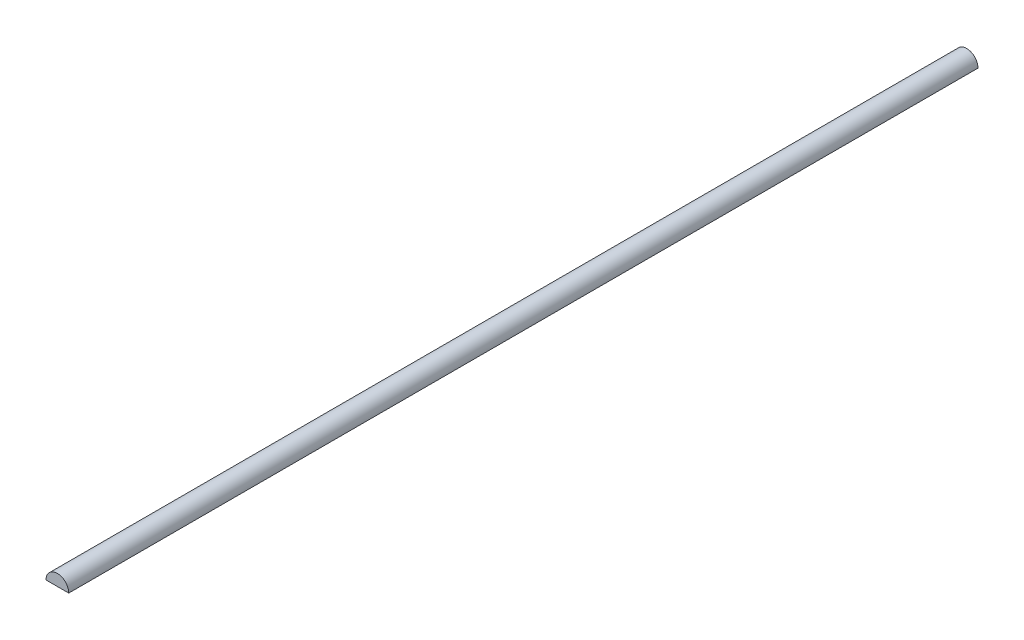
ISO-10303-21;
HEADER;
FILE_DESCRIPTION(('STEP AP214'),'2;1');
FILE_NAME('part.step','',(''),(''),'','','');
FILE_SCHEMA(('AUTOMOTIVE_DESIGN { 1 0 10303 214 1 1 1 1 }'));
ENDSEC;
DATA;
#1=APPLICATION_CONTEXT('core data for automotive mechanical design processes');
#2=APPLICATION_PROTOCOL_DEFINITION('international standard','automotive_design',2000,#1);
#3=PRODUCT_CONTEXT('',#1,'mechanical');
#4=PRODUCT('Part','Part','',(#3));
#5=PRODUCT_RELATED_PRODUCT_CATEGORY('part','',(#4));
#6=PRODUCT_DEFINITION_FORMATION('','',#4);
#7=PRODUCT_DEFINITION_CONTEXT('part definition',#1,'design');
#8=PRODUCT_DEFINITION('design','',#6,#7);
#9=PRODUCT_DEFINITION_SHAPE('','',#8);
#10=(LENGTH_UNIT() NAMED_UNIT(*) SI_UNIT(.MILLI.,.METRE.));
#11=(NAMED_UNIT(*) PLANE_ANGLE_UNIT() SI_UNIT($,.RADIAN.));
#12=(NAMED_UNIT(*) SI_UNIT($,.STERADIAN.) SOLID_ANGLE_UNIT());
#13=UNCERTAINTY_MEASURE_WITH_UNIT(LENGTH_MEASURE(1.E-05),#10,'distance_accuracy_value','');
#14=(GEOMETRIC_REPRESENTATION_CONTEXT(3) GLOBAL_UNCERTAINTY_ASSIGNED_CONTEXT((#13)) GLOBAL_UNIT_ASSIGNED_CONTEXT((#10,
#11,#12)) REPRESENTATION_CONTEXT('',''));
#15=CARTESIAN_POINT('',(0.,0.,0.));
#16=DIRECTION('',(0.,0.,1.));
#17=DIRECTION('',(1.,0.,0.));
#18=AXIS2_PLACEMENT_3D('',#15,#16,#17);
#19=CARTESIAN_POINT('',(0.,0.,400.));
#20=DIRECTION('',(0.,0.,-1.));
#21=DIRECTION('',(-1.,0.,0.));
#22=AXIS2_PLACEMENT_3D('',#19,#20,#21);
#23=CYLINDRICAL_SURFACE('',#22,5.);
#24=CARTESIAN_POINT('',(0.,0.,0.));
#25=DIRECTION('',(0.,0.,1.));
#26=DIRECTION('',(1.,0.,0.));
#27=AXIS2_PLACEMENT_3D('',#24,#25,#26);
#28=CIRCLE('',#27,5.);
#29=CARTESIAN_POINT('',(5.,0.,0.));
#30=VERTEX_POINT('',#29);
#31=CARTESIAN_POINT('',(-5.,0.,0.));
#32=VERTEX_POINT('',#31);
#33=EDGE_CURVE('E70',#30,#32,#28,.T.);
#34=ORIENTED_EDGE('',*,*,#33,.T.);
#35=DIRECTION('',(0.,0.,-1.));
#36=VECTOR('',#35,1.);
#37=CARTESIAN_POINT('',(-5.,0.,400.));
#38=LINE('',#37,#36);
#39=CARTESIAN_POINT('',(-5.,0.,400.));
#40=VERTEX_POINT('',#39);
#41=EDGE_CURVE('E11',#40,#32,#38,.T.);
#42=ORIENTED_EDGE('',*,*,#41,.F.);
#43=CARTESIAN_POINT('',(0.,0.,400.));
#44=DIRECTION('',(0.,0.,1.));
#45=DIRECTION('',(1.,0.,0.));
#46=AXIS2_PLACEMENT_3D('',#43,#44,#45);
#47=CIRCLE('',#46,5.);
#48=CARTESIAN_POINT('',(5.,0.,400.));
#49=VERTEX_POINT('',#48);
#50=EDGE_CURVE('E69',#49,#40,#47,.T.);
#51=ORIENTED_EDGE('',*,*,#50,.F.);
#52=DIRECTION('',(0.,0.,-1.));
#53=VECTOR('',#52,1.);
#54=CARTESIAN_POINT('',(5.,0.,400.));
#55=LINE('',#54,#53);
#56=EDGE_CURVE('E47',#49,#30,#55,.T.);
#57=ORIENTED_EDGE('',*,*,#56,.T.);
#58=EDGE_LOOP('',(#34,#42,#51,#57));
#59=FACE_BOUND('',#58,.T.);
#60=ADVANCED_FACE('F38',(#59),#23,.T.);
#61=CARTESIAN_POINT('',(-5.,0.,400.));
#62=DIRECTION('',(0.,1.,0.));
#63=DIRECTION('',(0.,0.,1.));
#64=AXIS2_PLACEMENT_3D('',#61,#62,#63);
#65=PLANE('',#64);
#66=DIRECTION('',(1.,0.,0.));
#67=VECTOR('',#66,1.);
#68=CARTESIAN_POINT('',(-5.,0.,0.));
#69=LINE('',#68,#67);
#70=EDGE_CURVE('E62',#32,#30,#69,.T.);
#71=ORIENTED_EDGE('',*,*,#70,.T.);
#72=ORIENTED_EDGE('',*,*,#56,.F.);
#73=DIRECTION('',(1.,0.,0.));
#74=VECTOR('',#73,1.);
#75=CARTESIAN_POINT('',(-5.,0.,400.));
#76=LINE('',#75,#74);
#77=EDGE_CURVE('E54',#40,#49,#76,.T.);
#78=ORIENTED_EDGE('',*,*,#77,.F.);
#79=ORIENTED_EDGE('',*,*,#41,.T.);
#80=EDGE_LOOP('',(#71,#72,#78,#79));
#81=FACE_BOUND('',#80,.T.);
#82=ADVANCED_FACE('F65',(#81),#65,.F.);
#83=CARTESIAN_POINT('',(0.,0.,400.));
#84=DIRECTION('',(0.,0.,1.));
#85=DIRECTION('',(1.,0.,0.));
#86=AXIS2_PLACEMENT_3D('',#83,#84,#85);
#87=PLANE('',#86);
#88=ORIENTED_EDGE('',*,*,#50,.T.);
#89=ORIENTED_EDGE('',*,*,#77,.T.);
#90=EDGE_LOOP('',(#88,#89));
#91=FACE_BOUND('',#90,.T.);
#92=ADVANCED_FACE('F78',(#91),#87,.T.);
#93=CARTESIAN_POINT('',(0.,0.,0.));
#94=DIRECTION('',(0.,0.,1.));
#95=DIRECTION('',(1.,0.,0.));
#96=AXIS2_PLACEMENT_3D('',#93,#94,#95);
#97=PLANE('',#96);
#98=ORIENTED_EDGE('',*,*,#33,.F.);
#99=ORIENTED_EDGE('',*,*,#70,.F.);
#100=EDGE_LOOP('',(#98,#99));
#101=FACE_BOUND('',#100,.T.);
#102=ADVANCED_FACE('F74',(#101),#97,.F.);
#103=CLOSED_SHELL('',(#60,#82,#92,#102));
#104=MANIFOLD_SOLID_BREP('B2',#103);
#105=ADVANCED_BREP_SHAPE_REPRESENTATION('',(#18,#104),#14);
#106=SHAPE_DEFINITION_REPRESENTATION(#9,#105);
ENDSEC;
END-ISO-10303-21;
